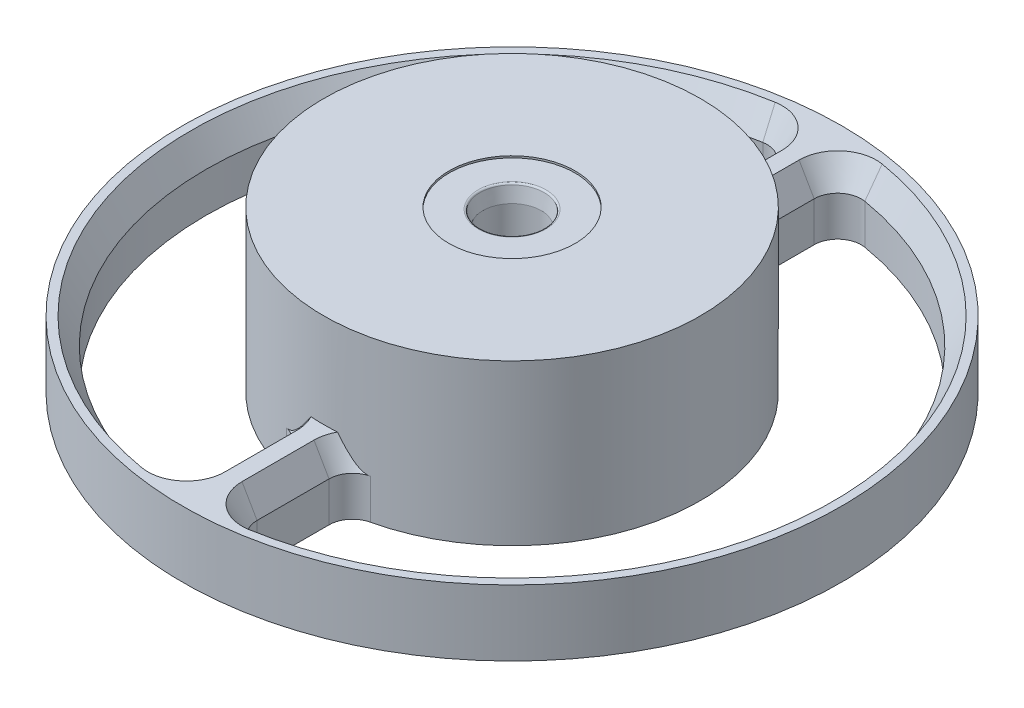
ISO-10303-21;
HEADER;
FILE_DESCRIPTION(('STEP AP214'),'2;1');
FILE_NAME('part.step','',(''),(''),'','','');
FILE_SCHEMA(('AUTOMOTIVE_DESIGN { 1 0 10303 214 1 1 1 1 }'));
ENDSEC;
DATA;
#1=APPLICATION_CONTEXT('core data for automotive mechanical design processes');
#2=APPLICATION_PROTOCOL_DEFINITION('international standard','automotive_design',2000,#1);
#3=PRODUCT_CONTEXT('',#1,'mechanical');
#4=PRODUCT('Part','Part','',(#3));
#5=PRODUCT_RELATED_PRODUCT_CATEGORY('part','',(#4));
#6=PRODUCT_DEFINITION_FORMATION('','',#4);
#7=PRODUCT_DEFINITION_CONTEXT('part definition',#1,'design');
#8=PRODUCT_DEFINITION('design','',#6,#7);
#9=PRODUCT_DEFINITION_SHAPE('','',#8);
#10=(LENGTH_UNIT() NAMED_UNIT(*) SI_UNIT(.MILLI.,.METRE.));
#11=(NAMED_UNIT(*) PLANE_ANGLE_UNIT() SI_UNIT($,.RADIAN.));
#12=(NAMED_UNIT(*) SI_UNIT($,.STERADIAN.) SOLID_ANGLE_UNIT());
#13=UNCERTAINTY_MEASURE_WITH_UNIT(LENGTH_MEASURE(1.E-05),#10,'distance_accuracy_value','');
#14=(GEOMETRIC_REPRESENTATION_CONTEXT(3) GLOBAL_UNCERTAINTY_ASSIGNED_CONTEXT((#13)) GLOBAL_UNIT_ASSIGNED_CONTEXT((#10,
#11,#12)) REPRESENTATION_CONTEXT('',''));
#15=CARTESIAN_POINT('',(0.,0.,0.));
#16=DIRECTION('',(0.,0.,1.));
#17=DIRECTION('',(1.,0.,0.));
#18=AXIS2_PLACEMENT_3D('',#15,#16,#17);
#19=CARTESIAN_POINT('',(-44.45,-21.59,0.));
#20=DIRECTION('',(0.,1.,0.));
#21=DIRECTION('',(0.,0.,1.));
#22=AXIS2_PLACEMENT_3D('',#19,#20,#21);
#23=PLANE('',#22);
#24=CARTESIAN_POINT('',(0.,-21.59,0.));
#25=DIRECTION('',(0.,-1.,0.));
#26=DIRECTION('',(0.,0.,-1.));
#27=AXIS2_PLACEMENT_3D('',#24,#25,#26);
#28=CIRCLE('',#27,44.45);
#29=CARTESIAN_POINT('',(0.,-21.59,-44.45));
#30=VERTEX_POINT('',#29);
#31=EDGE_CURVE('E282',#30,#30,#28,.T.);
#32=ORIENTED_EDGE('',*,*,#31,.T.);
#33=EDGE_LOOP('',(#32));
#34=FACE_BOUND('',#33,.T.);
#35=DIRECTION('',(0.,0.,-1.));
#36=VECTOR('',#35,1.);
#37=CARTESIAN_POINT('',(-3.17499999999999,-21.59,37.5671066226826));
#38=LINE('',#37,#36);
#39=CARTESIAN_POINT('',(-3.17499999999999,-21.59,37.5671066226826));
#40=VERTEX_POINT('',#39);
#41=CARTESIAN_POINT('',(-3.17499999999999,-21.59,27.86051192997));
#42=VERTEX_POINT('',#41);
#43=EDGE_CURVE('E275',#40,#42,#38,.T.);
#44=ORIENTED_EDGE('',*,*,#43,.T.);
#45=CARTESIAN_POINT('',(-6.34999999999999,-21.59,27.86051192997));
#46=DIRECTION('',(0.,1.,0.));
#47=DIRECTION('',(1.,0.,0.));
#48=AXIS2_PLACEMENT_3D('',#45,#46,#47);
#49=CIRCLE('',#48,3.175);
#50=CARTESIAN_POINT('',(-5.64444444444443,-21.59,24.7648994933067));
#51=VERTEX_POINT('',#50);
#52=EDGE_CURVE('E238',#42,#51,#49,.T.);
#53=ORIENTED_EDGE('',*,*,#52,.T.);
#54=CARTESIAN_POINT('',(0.,-21.59,0.));
#55=DIRECTION('',(0.,-1.,0.));
#56=DIRECTION('',(1.,0.,0.));
#57=AXIS2_PLACEMENT_3D('',#54,#55,#56);
#58=CIRCLE('',#57,25.4);
#59=CARTESIAN_POINT('',(-5.64444444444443,-21.59,-24.7648994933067));
#60=VERTEX_POINT('',#59);
#61=EDGE_CURVE('E257',#51,#60,#58,.T.);
#62=ORIENTED_EDGE('',*,*,#61,.T.);
#63=CARTESIAN_POINT('',(-6.34999999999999,-21.59,-27.86051192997));
#64=DIRECTION('',(0.,1.,0.));
#65=DIRECTION('',(-1.,0.,0.));
#66=AXIS2_PLACEMENT_3D('',#63,#64,#65);
#67=CIRCLE('',#66,3.175);
#68=CARTESIAN_POINT('',(-3.17499999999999,-21.59,-27.86051192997));
#69=VERTEX_POINT('',#68);
#70=EDGE_CURVE('E260',#60,#69,#67,.T.);
#71=ORIENTED_EDGE('',*,*,#70,.T.);
#72=DIRECTION('',(0.,0.,-1.));
#73=VECTOR('',#72,1.);
#74=CARTESIAN_POINT('',(-3.17499999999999,-21.59,-37.5671066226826));
#75=LINE('',#74,#73);
#76=CARTESIAN_POINT('',(-3.17499999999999,-21.59,-37.5671066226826));
#77=VERTEX_POINT('',#76);
#78=EDGE_CURVE('E263',#69,#77,#75,.T.);
#79=ORIENTED_EDGE('',*,*,#78,.T.);
#80=CARTESIAN_POINT('',(-6.34999999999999,-21.59,-37.5671066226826));
#81=DIRECTION('',(0.,1.,0.));
#82=DIRECTION('',(1.,0.,0.));
#83=AXIS2_PLACEMENT_3D('',#80,#81,#82);
#84=CIRCLE('',#83,3.17499999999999);
#85=CARTESIAN_POINT('',(-6.87916666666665,-21.59,-40.6976988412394));
#86=VERTEX_POINT('',#85);
#87=EDGE_CURVE('E266',#77,#86,#84,.T.);
#88=ORIENTED_EDGE('',*,*,#87,.T.);
#89=CARTESIAN_POINT('',(0.,-21.59,0.));
#90=DIRECTION('',(0.,1.,0.));
#91=DIRECTION('',(1.,0.,0.));
#92=AXIS2_PLACEMENT_3D('',#89,#90,#91);
#93=CIRCLE('',#92,41.275);
#94=CARTESIAN_POINT('',(-6.87916666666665,-21.59,40.6976988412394));
#95=VERTEX_POINT('',#94);
#96=EDGE_CURVE('E269',#86,#95,#93,.T.);
#97=ORIENTED_EDGE('',*,*,#96,.T.);
#98=CARTESIAN_POINT('',(-6.34999999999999,-21.59,37.5671066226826));
#99=DIRECTION('',(0.,1.,0.));
#100=DIRECTION('',(-1.,0.,0.));
#101=AXIS2_PLACEMENT_3D('',#98,#99,#100);
#102=CIRCLE('',#101,3.175);
#103=EDGE_CURVE('E272',#95,#40,#102,.T.);
#104=ORIENTED_EDGE('',*,*,#103,.T.);
#105=EDGE_LOOP('',(#44,#53,#62,#71,#79,#88,#97,#104));
#106=FACE_BOUND('',#105,.T.);
#107=DIRECTION('',(0.,0.,1.));
#108=VECTOR('',#107,1.);
#109=CARTESIAN_POINT('',(3.17500000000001,-21.59,37.5671066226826));
#110=LINE('',#109,#108);
#111=CARTESIAN_POINT('',(3.17500000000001,-21.59,27.86051192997));
#112=VERTEX_POINT('',#111);
#113=CARTESIAN_POINT('',(3.17500000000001,-21.59,37.5671066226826));
#114=VERTEX_POINT('',#113);
#115=EDGE_CURVE('E204',#112,#114,#110,.T.);
#116=ORIENTED_EDGE('',*,*,#115,.T.);
#117=CARTESIAN_POINT('',(6.35000000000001,-21.59,37.5671066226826));
#118=DIRECTION('',(0.,1.,0.));
#119=DIRECTION('',(1.,0.,0.));
#120=AXIS2_PLACEMENT_3D('',#117,#118,#119);
#121=CIRCLE('',#120,3.175);
#122=CARTESIAN_POINT('',(6.87916666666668,-21.59,40.6976988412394));
#123=VERTEX_POINT('',#122);
#124=EDGE_CURVE('E201',#114,#123,#121,.T.);
#125=ORIENTED_EDGE('',*,*,#124,.T.);
#126=CARTESIAN_POINT('',(0.,-21.59,0.));
#127=DIRECTION('',(0.,1.,0.));
#128=DIRECTION('',(-1.,0.,0.));
#129=AXIS2_PLACEMENT_3D('',#126,#127,#128);
#130=CIRCLE('',#129,41.275);
#131=CARTESIAN_POINT('',(6.87916666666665,-21.59,-40.6976988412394));
#132=VERTEX_POINT('',#131);
#133=EDGE_CURVE('E207',#123,#132,#130,.T.);
#134=ORIENTED_EDGE('',*,*,#133,.T.);
#135=CARTESIAN_POINT('',(6.34999999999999,-21.59,-37.5671066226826));
#136=DIRECTION('',(0.,1.,0.));
#137=DIRECTION('',(-1.,0.,0.));
#138=AXIS2_PLACEMENT_3D('',#135,#136,#137);
#139=CIRCLE('',#138,3.17499999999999);
#140=CARTESIAN_POINT('',(3.175,-21.59,-37.5671066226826));
#141=VERTEX_POINT('',#140);
#142=EDGE_CURVE('E211',#132,#141,#139,.T.);
#143=ORIENTED_EDGE('',*,*,#142,.T.);
#144=DIRECTION('',(0.,0.,1.));
#145=VECTOR('',#144,1.);
#146=CARTESIAN_POINT('',(3.17499999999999,-21.59,-37.5671066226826));
#147=LINE('',#146,#145);
#148=CARTESIAN_POINT('',(3.17499999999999,-21.59,-27.86051192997));
#149=VERTEX_POINT('',#148);
#150=EDGE_CURVE('E224',#141,#149,#147,.T.);
#151=ORIENTED_EDGE('',*,*,#150,.T.);
#152=CARTESIAN_POINT('',(6.34999999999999,-21.59,-27.86051192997));
#153=DIRECTION('',(0.,1.,0.));
#154=DIRECTION('',(1.,0.,0.));
#155=AXIS2_PLACEMENT_3D('',#152,#153,#154);
#156=CIRCLE('',#155,3.175);
#157=CARTESIAN_POINT('',(5.64444444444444,-21.59,-24.7648994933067));
#158=VERTEX_POINT('',#157);
#159=EDGE_CURVE('E227',#149,#158,#156,.T.);
#160=ORIENTED_EDGE('',*,*,#159,.T.);
#161=CARTESIAN_POINT('',(0.,-21.59,0.));
#162=DIRECTION('',(0.,-1.,0.));
#163=DIRECTION('',(-1.,0.,0.));
#164=AXIS2_PLACEMENT_3D('',#161,#162,#163);
#165=CIRCLE('',#164,25.4);
#166=CARTESIAN_POINT('',(5.64444444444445,-21.59,24.7648994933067));
#167=VERTEX_POINT('',#166);
#168=EDGE_CURVE('E230',#158,#167,#165,.T.);
#169=ORIENTED_EDGE('',*,*,#168,.T.);
#170=CARTESIAN_POINT('',(6.35000000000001,-21.59,27.86051192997));
#171=DIRECTION('',(0.,1.,0.));
#172=DIRECTION('',(-1.,0.,0.));
#173=AXIS2_PLACEMENT_3D('',#170,#171,#172);
#174=CIRCLE('',#173,3.175);
#175=EDGE_CURVE('E233',#167,#112,#174,.T.);
#176=ORIENTED_EDGE('',*,*,#175,.T.);
#177=EDGE_LOOP('',(#116,#125,#134,#143,#151,#160,#169,#176));
#178=FACE_BOUND('',#177,.T.);
#179=CARTESIAN_POINT('',(0.,-21.59,0.));
#180=DIRECTION('',(0.,1.,0.));
#181=DIRECTION('',(0.,0.,1.));
#182=AXIS2_PLACEMENT_3D('',#179,#180,#181);
#183=CIRCLE('',#182,9.652);
#184=CARTESIAN_POINT('',(0.,-21.59,9.652));
#185=VERTEX_POINT('',#184);
#186=EDGE_CURVE('E219',#185,#185,#183,.T.);
#187=ORIENTED_EDGE('',*,*,#186,.T.);
#188=EDGE_LOOP('',(#187));
#189=FACE_BOUND('',#188,.T.);
#190=ADVANCED_FACE('F34',(#34,#106,#178,#189),#23,.F.);
#191=CARTESIAN_POINT('',(0.,0.,0.));
#192=DIRECTION('',(0.,-1.,0.));
#193=DIRECTION('',(0.,0.,-1.));
#194=AXIS2_PLACEMENT_3D('',#191,#192,#193);
#195=PLANE('',#194);
#196=CARTESIAN_POINT('',(0.,0.,0.));
#197=DIRECTION('',(0.,1.,0.));
#198=DIRECTION('',(0.,0.,1.));
#199=AXIS2_PLACEMENT_3D('',#196,#197,#198);
#200=CIRCLE('',#199,8.5);
#201=CARTESIAN_POINT('',(0.,0.,8.5));
#202=VERTEX_POINT('',#201);
#203=EDGE_CURVE('E930',#202,#202,#200,.T.);
#204=ORIENTED_EDGE('',*,*,#203,.F.);
#205=EDGE_LOOP('',(#204));
#206=FACE_BOUND('',#205,.T.);
#207=CARTESIAN_POINT('',(0.,0.,0.));
#208=DIRECTION('',(0.,-1.,0.));
#209=DIRECTION('',(0.,0.,-1.));
#210=AXIS2_PLACEMENT_3D('',#207,#208,#209);
#211=CIRCLE('',#210,25.4);
#212=CARTESIAN_POINT('',(0.,0.,-25.4));
#213=VERTEX_POINT('',#212);
#214=EDGE_CURVE('E312',#213,#213,#211,.T.);
#215=ORIENTED_EDGE('',*,*,#214,.F.);
#216=EDGE_LOOP('',(#215));
#217=FACE_BOUND('',#216,.T.);
#218=ADVANCED_FACE('F394',(#206,#217),#195,.F.);
#219=CARTESIAN_POINT('',(0.,0.,0.));
#220=DIRECTION('',(0.,-1.,0.));
#221=DIRECTION('',(0.,0.,-1.));
#222=AXIS2_PLACEMENT_3D('',#219,#220,#221);
#223=CYLINDRICAL_SURFACE('',#222,25.4);
#224=CARTESIAN_POINT('',(0.,-12.7,0.));
#225=DIRECTION('',(0.,-1.,0.));
#226=DIRECTION('',(0.,0.,-1.));
#227=AXIS2_PLACEMENT_3D('',#224,#225,#226);
#228=CIRCLE('',#227,25.4);
#229=CARTESIAN_POINT('',(-1.79566705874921,-12.7,-25.3364476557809));
#230=VERTEX_POINT('',#229);
#231=CARTESIAN_POINT('',(1.79566705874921,-12.7,-25.3364476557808));
#232=VERTEX_POINT('',#231);
#233=EDGE_CURVE('E309',#230,#232,#228,.T.);
#234=ORIENTED_EDGE('',*,*,#233,.F.);
#235=CARTESIAN_POINT('',(-1.79566705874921,-12.7,-25.3364476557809));
#236=CARTESIAN_POINT('',(-1.89089241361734,-12.8385463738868,-25.3296947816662));
#237=CARTESIAN_POINT('',(-1.98690869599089,-12.9765322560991,-25.3223541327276));
#238=CARTESIAN_POINT('',(-2.18101546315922,-13.2510683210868,-25.3063769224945));
#239=CARTESIAN_POINT('',(-2.27910700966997,-13.3876177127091,-25.2977396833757));
#240=CARTESIAN_POINT('',(-2.47971236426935,-13.6614884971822,-25.2788719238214));
#241=CARTESIAN_POINT('',(-2.58227521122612,-13.7987721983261,-25.2686133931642));
#242=CARTESIAN_POINT('',(-2.79060472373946,-14.0706973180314,-25.2464552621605));
#243=CARTESIAN_POINT('',(-2.89637043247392,-14.2053395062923,-25.23455614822));
#244=CARTESIAN_POINT('',(-3.11223944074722,-14.4713418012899,-25.2088438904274));
#245=CARTESIAN_POINT('',(-3.22235015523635,-14.6026956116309,-25.1950273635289));
#246=CARTESIAN_POINT('',(-3.447979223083,-14.8603671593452,-25.165142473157));
#247=CARTESIAN_POINT('',(-3.56349591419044,-14.9866864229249,-25.1490747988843));
#248=CARTESIAN_POINT('',(-3.80114017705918,-15.2312969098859,-25.1142531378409));
#249=CARTESIAN_POINT('',(-3.92322562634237,-15.3496303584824,-25.0955152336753));
#250=CARTESIAN_POINT('',(-4.11352098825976,-15.5183991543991,-25.0647768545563));
#251=CARTESIAN_POINT('',(-4.17809796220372,-15.5731636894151,-25.05410082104));
#252=CARTESIAN_POINT('',(-4.31004996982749,-15.6789715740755,-25.0317389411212));
#253=CARTESIAN_POINT('',(-4.3774238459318,-15.7300164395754,-25.0200535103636));
#254=CARTESIAN_POINT('',(-4.49605478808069,-15.8136732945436,-24.9989605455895));
#255=CARTESIAN_POINT('',(-4.54653951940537,-15.8474431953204,-24.9898319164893));
#256=CARTESIAN_POINT('',(-4.64927981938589,-15.9119497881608,-24.9709217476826));
#257=CARTESIAN_POINT('',(-4.7015355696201,-15.942686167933,-24.9611401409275));
#258=CARTESIAN_POINT('',(-4.86056049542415,-16.0290689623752,-24.9308346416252));
#259=CARTESIAN_POINT('',(-4.97024504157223,-16.0793713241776,-24.9092341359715));
#260=CARTESIAN_POINT('',(-5.12806864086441,-16.1351182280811,-24.8769976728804));
#261=CARTESIAN_POINT('',(-5.17343783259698,-16.1493217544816,-24.8676041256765));
#262=CARTESIAN_POINT('',(-5.26506667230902,-16.1740698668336,-24.8483653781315));
#263=CARTESIAN_POINT('',(-5.31132595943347,-16.184615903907,-24.8385203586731));
#264=CARTESIAN_POINT('',(-5.40519377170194,-16.2018258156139,-24.8182637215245));
#265=CARTESIAN_POINT('',(-5.45281212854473,-16.2084292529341,-24.8078458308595));
#266=CARTESIAN_POINT('',(-5.54844013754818,-16.2172974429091,-24.7866341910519));
#267=CARTESIAN_POINT('',(-5.59645026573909,-16.2195557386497,-24.7758399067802));
#268=CARTESIAN_POINT('',(-5.64444444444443,-16.2195272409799,-24.7648994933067));
#269=B_SPLINE_CURVE_WITH_KNOTS('',3,(#235,#236,#237,#238,#239,#240,#241,#242,#243,#244,#245,
#246,#247,#248,#249,#250,#251,#252,#253,#254,#255,#256,#257,#258,#259,#260,#261,#262,#263,#264,
#265,#266,#267,#268),.UNSPECIFIED.,.F.,.F.,(4,2,2,2,2,2,2,2,2,2,2,2,2,2,2,2,4),(0.,
0.50476505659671,1.00979491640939,1.52476363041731,2.03957999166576,2.55531651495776,
3.07089548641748,3.58349101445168,3.83941843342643,4.09524096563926,4.27939852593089,
4.46357502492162,4.82947103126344,4.97473430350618,5.11993987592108,5.26731772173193,
5.414914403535),.UNSPECIFIED.);
#270=CARTESIAN_POINT('',(-5.64444444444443,-16.2195272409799,-24.7648994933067));
#271=VERTEX_POINT('',#270);
#272=EDGE_CURVE('E371',#230,#271,#269,.T.);
#273=ORIENTED_EDGE('',*,*,#272,.T.);
#274=DIRECTION('',(0.,1.,0.));
#275=VECTOR('',#274,1.);
#276=CARTESIAN_POINT('',(-5.64444444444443,-21.59,-24.7648994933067));
#277=LINE('',#276,#275);
#278=EDGE_CURVE('E298',#60,#271,#277,.T.);
#279=ORIENTED_EDGE('',*,*,#278,.F.);
#280=ORIENTED_EDGE('',*,*,#61,.F.);
#281=DIRECTION('',(0.,1.,0.));
#282=VECTOR('',#281,1.);
#283=CARTESIAN_POINT('',(-5.64444444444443,-21.59,24.7648994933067));
#284=LINE('',#283,#282);
#285=CARTESIAN_POINT('',(-5.64444444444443,-16.2195272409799,24.7648994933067));
#286=VERTEX_POINT('',#285);
#287=EDGE_CURVE('E278',#51,#286,#284,.T.);
#288=ORIENTED_EDGE('',*,*,#287,.T.);
#289=CARTESIAN_POINT('',(-5.64444444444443,-16.2195272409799,24.7648994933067));
#290=CARTESIAN_POINT('',(-5.5877647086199,-16.2195807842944,24.7778208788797));
#291=CARTESIAN_POINT('',(-5.53107452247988,-16.2164178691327,24.7905343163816));
#292=CARTESIAN_POINT('',(-5.41837993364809,-16.204085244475,24.8154073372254));
#293=CARTESIAN_POINT('',(-5.36237412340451,-16.1949312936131,24.8275682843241));
#294=CARTESIAN_POINT('',(-5.25286394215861,-16.1713427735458,24.8509655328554));
#295=CARTESIAN_POINT('',(-5.19933218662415,-16.1570485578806,24.8622174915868));
#296=CARTESIAN_POINT('',(-5.09359581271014,-16.1237590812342,24.8840952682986));
#297=CARTESIAN_POINT('',(-5.04139215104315,-16.1047605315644,24.8947206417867));
#298=CARTESIAN_POINT('',(-4.91830370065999,-16.0544425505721,24.9193826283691));
#299=CARTESIAN_POINT('',(-4.84814007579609,-16.0212153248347,24.9331187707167));
#300=CARTESIAN_POINT('',(-4.71089946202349,-15.948543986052,24.9594133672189));
#301=CARTESIAN_POINT('',(-4.64382393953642,-15.9090969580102,24.9719712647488));
#302=CARTESIAN_POINT('',(-4.51090576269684,-15.8242783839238,24.9963279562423));
#303=CARTESIAN_POINT('',(-4.44513948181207,-15.778780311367,25.0080988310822));
#304=CARTESIAN_POINT('',(-4.31640383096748,-15.6838470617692,25.0306397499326));
#305=CARTESIAN_POINT('',(-4.25343334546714,-15.6344134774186,25.0414101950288));
#306=CARTESIAN_POINT('',(-4.12748685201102,-15.5304384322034,25.0624836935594));
#307=CARTESIAN_POINT('',(-4.06460835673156,-15.4757724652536,25.0727516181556));
#308=CARTESIAN_POINT('',(-3.94111272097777,-15.3637920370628,25.0924597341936));
#309=CARTESIAN_POINT('',(-3.88049606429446,-15.3064770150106,25.1018997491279));
#310=CARTESIAN_POINT('',(-3.70145449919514,-15.1312829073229,25.1291436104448));
#311=CARTESIAN_POINT('',(-3.58595051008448,-15.0102507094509,25.1458526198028));
#312=CARTESIAN_POINT('',(-3.36022449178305,-14.762045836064,25.1770114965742));
#313=CARTESIAN_POINT('',(-3.25003195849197,-14.6348453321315,25.1914495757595));
#314=CARTESIAN_POINT('',(-3.03411042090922,-14.3764893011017,25.2183664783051));
#315=CARTESIAN_POINT('',(-2.92838220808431,-14.2453330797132,25.2308449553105));
#316=CARTESIAN_POINT('',(-2.73407356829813,-13.9975754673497,25.2525858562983));
#317=CARTESIAN_POINT('',(-2.64506513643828,-13.881325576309,25.2620554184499));
#318=CARTESIAN_POINT('',(-2.46918238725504,-13.6471144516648,25.2798526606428));
#319=CARTESIAN_POINT('',(-2.38230836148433,-13.5291529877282,25.2881801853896));
#320=CARTESIAN_POINT('',(-2.21131659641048,-13.2932439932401,25.3037026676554));
#321=CARTESIAN_POINT('',(-2.12717866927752,-13.1753118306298,25.3109095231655));
#322=CARTESIAN_POINT('',(-1.96038456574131,-12.9383945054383,25.3243729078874));
#323=CARTESIAN_POINT('',(-1.8777280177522,-12.81940961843,25.3306296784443));
#324=CARTESIAN_POINT('',(-1.79566705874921,-12.7,25.3364476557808));
#325=B_SPLINE_CURVE_WITH_KNOTS('',3,(#289,#290,#291,#292,#293,#294,#295,#296,#297,#298,#299,
#300,#301,#302,#303,#304,#305,#306,#307,#308,#309,#310,#311,#312,#313,#314,#315,#316,#317,#318,
#319,#320,#321,#322,#323,#324),.UNSPECIFIED.,.F.,.F.,(4,2,2,2,2,2,2,2,2,2,2,2,2,2,2,2,2,4),(0.,
0.174258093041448,0.348059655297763,0.517436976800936,0.686933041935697,0.923041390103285,
1.15926072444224,1.40157035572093,1.64378241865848,1.89553653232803,2.14734418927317,
2.65140544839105,3.15800254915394,3.6646890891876,4.10481059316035,4.54499188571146,
4.98012288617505,5.41514316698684),.UNSPECIFIED.);
#326=CARTESIAN_POINT('',(-1.79566705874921,-12.7,25.3364476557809));
#327=VERTEX_POINT('',#326);
#328=EDGE_CURVE('E378',#286,#327,#325,.T.);
#329=ORIENTED_EDGE('',*,*,#328,.T.);
#330=CARTESIAN_POINT('',(1.79566705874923,-12.7,25.3364476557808));
#331=VERTEX_POINT('',#330);
#332=EDGE_CURVE('E308',#331,#327,#228,.T.);
#333=ORIENTED_EDGE('',*,*,#332,.F.);
#334=CARTESIAN_POINT('',(1.79566705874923,-12.7,25.3364476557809));
#335=CARTESIAN_POINT('',(1.89089241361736,-12.8385463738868,25.3296947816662));
#336=CARTESIAN_POINT('',(1.98690869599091,-12.9765322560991,25.3223541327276));
#337=CARTESIAN_POINT('',(2.18101546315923,-13.2510683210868,25.3063769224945));
#338=CARTESIAN_POINT('',(2.27910700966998,-13.3876177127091,25.2977396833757));
#339=CARTESIAN_POINT('',(2.47971236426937,-13.6614884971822,25.2788719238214));
#340=CARTESIAN_POINT('',(2.58227521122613,-13.7987721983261,25.2686133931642));
#341=CARTESIAN_POINT('',(2.79060472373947,-14.0706973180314,25.2464552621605));
#342=CARTESIAN_POINT('',(2.89637043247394,-14.2053395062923,25.23455614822));
#343=CARTESIAN_POINT('',(3.11223944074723,-14.4713418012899,25.2088438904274));
#344=CARTESIAN_POINT('',(3.22235015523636,-14.6026956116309,25.1950273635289));
#345=CARTESIAN_POINT('',(3.447979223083,-14.8603671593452,25.165142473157));
#346=CARTESIAN_POINT('',(3.56349591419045,-14.9866864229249,25.1490747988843));
#347=CARTESIAN_POINT('',(3.80114017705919,-15.2312969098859,25.1142531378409));
#348=CARTESIAN_POINT('',(3.92322562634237,-15.3496303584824,25.0955152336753));
#349=CARTESIAN_POINT('',(4.11352098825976,-15.5183991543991,25.0647768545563));
#350=CARTESIAN_POINT('',(4.17809796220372,-15.5731636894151,25.05410082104));
#351=CARTESIAN_POINT('',(4.3100499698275,-15.6789715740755,25.0317389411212));
#352=CARTESIAN_POINT('',(4.3774238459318,-15.7300164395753,25.0200535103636));
#353=CARTESIAN_POINT('',(4.49605478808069,-15.8136732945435,24.9989605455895));
#354=CARTESIAN_POINT('',(4.54653951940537,-15.8474431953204,24.9898319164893));
#355=CARTESIAN_POINT('',(4.64927981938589,-15.9119497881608,24.9709217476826));
#356=CARTESIAN_POINT('',(4.7015355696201,-15.942686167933,24.9611401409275));
#357=CARTESIAN_POINT('',(4.86056049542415,-16.0290689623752,24.9308346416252));
#358=CARTESIAN_POINT('',(4.97024504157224,-16.0793713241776,24.9092341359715));
#359=CARTESIAN_POINT('',(5.12806864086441,-16.1351182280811,24.8769976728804));
#360=CARTESIAN_POINT('',(5.17343783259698,-16.1493217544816,24.8676041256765));
#361=CARTESIAN_POINT('',(5.26506667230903,-16.1740698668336,24.8483653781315));
#362=CARTESIAN_POINT('',(5.31132595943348,-16.184615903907,24.8385203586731));
#363=CARTESIAN_POINT('',(5.40519377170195,-16.2018258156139,24.8182637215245));
#364=CARTESIAN_POINT('',(5.45281212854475,-16.2084292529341,24.8078458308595));
#365=CARTESIAN_POINT('',(5.5484401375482,-16.2172974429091,24.7866341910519));
#366=CARTESIAN_POINT('',(5.59645026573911,-16.2195557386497,24.7758399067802));
#367=CARTESIAN_POINT('',(5.64444444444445,-16.2195272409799,24.7648994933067));
#368=B_SPLINE_CURVE_WITH_KNOTS('',3,(#334,#335,#336,#337,#338,#339,#340,#341,#342,#343,#344,
#345,#346,#347,#348,#349,#350,#351,#352,#353,#354,#355,#356,#357,#358,#359,#360,#361,#362,#363,
#364,#365,#366,#367),.UNSPECIFIED.,.F.,.F.,(4,2,2,2,2,2,2,2,2,2,2,2,2,2,2,2,4),(0.,
0.504765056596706,1.00979491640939,1.52476363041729,2.03957999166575,2.55531651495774,
3.07089548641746,3.58349101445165,3.8394184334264,4.09524096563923,4.27939852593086,
4.46357502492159,4.82947103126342,4.97473430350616,5.11993987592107,5.26731772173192,
5.414914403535),.UNSPECIFIED.);
#369=CARTESIAN_POINT('',(5.64444444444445,-16.2195272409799,24.7648994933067));
#370=VERTEX_POINT('',#369);
#371=EDGE_CURVE('E44',#331,#370,#368,.T.);
#372=ORIENTED_EDGE('',*,*,#371,.T.);
#373=DIRECTION('',(0.,1.,0.));
#374=VECTOR('',#373,1.);
#375=CARTESIAN_POINT('',(5.64444444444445,-21.59,24.7648994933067));
#376=LINE('',#375,#374);
#377=EDGE_CURVE('E242',#167,#370,#376,.T.);
#378=ORIENTED_EDGE('',*,*,#377,.F.);
#379=ORIENTED_EDGE('',*,*,#168,.F.);
#380=DIRECTION('',(0.,1.,0.));
#381=VECTOR('',#380,1.);
#382=CARTESIAN_POINT('',(5.64444444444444,-21.59,-24.7648994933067));
#383=LINE('',#382,#381);
#384=CARTESIAN_POINT('',(5.64444444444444,-16.2195272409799,-24.7648994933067));
#385=VERTEX_POINT('',#384);
#386=EDGE_CURVE('E245',#158,#385,#383,.T.);
#387=ORIENTED_EDGE('',*,*,#386,.T.);
#388=CARTESIAN_POINT('',(5.64444444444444,-16.2195272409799,-24.7648994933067));
#389=CARTESIAN_POINT('',(5.5877647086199,-16.2195807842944,-24.7778208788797));
#390=CARTESIAN_POINT('',(5.53107452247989,-16.2164178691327,-24.7905343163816));
#391=CARTESIAN_POINT('',(5.4183799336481,-16.2040852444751,-24.8154073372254));
#392=CARTESIAN_POINT('',(5.36237412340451,-16.1949312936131,-24.8275682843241));
#393=CARTESIAN_POINT('',(5.25286394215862,-16.1713427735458,-24.8509655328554));
#394=CARTESIAN_POINT('',(5.19933218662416,-16.1570485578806,-24.8622174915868));
#395=CARTESIAN_POINT('',(5.09359581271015,-16.1237590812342,-24.8840952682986));
#396=CARTESIAN_POINT('',(5.04139215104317,-16.1047605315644,-24.8947206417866));
#397=CARTESIAN_POINT('',(4.91830370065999,-16.0544425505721,-24.9193826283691));
#398=CARTESIAN_POINT('',(4.8481400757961,-16.0212153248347,-24.9331187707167));
#399=CARTESIAN_POINT('',(4.71089946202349,-15.948543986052,-24.9594133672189));
#400=CARTESIAN_POINT('',(4.64382393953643,-15.9090969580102,-24.9719712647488));
#401=CARTESIAN_POINT('',(4.51090576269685,-15.8242783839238,-24.9963279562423));
#402=CARTESIAN_POINT('',(4.44513948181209,-15.778780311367,-25.0080988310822));
#403=CARTESIAN_POINT('',(4.31640383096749,-15.6838470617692,-25.0306397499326));
#404=CARTESIAN_POINT('',(4.25343334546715,-15.6344134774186,-25.0414101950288));
#405=CARTESIAN_POINT('',(4.12748685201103,-15.5304384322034,-25.0624836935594));
#406=CARTESIAN_POINT('',(4.06460835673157,-15.4757724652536,-25.0727516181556));
#407=CARTESIAN_POINT('',(3.94111272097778,-15.3637920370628,-25.0924597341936));
#408=CARTESIAN_POINT('',(3.88049606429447,-15.3064770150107,-25.1018997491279));
#409=CARTESIAN_POINT('',(3.70145449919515,-15.1312829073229,-25.1291436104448));
#410=CARTESIAN_POINT('',(3.58595051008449,-15.0102507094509,-25.1458526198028));
#411=CARTESIAN_POINT('',(3.36022449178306,-14.762045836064,-25.1770114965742));
#412=CARTESIAN_POINT('',(3.25003195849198,-14.6348453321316,-25.1914495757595));
#413=CARTESIAN_POINT('',(3.03411042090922,-14.3764893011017,-25.2183664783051));
#414=CARTESIAN_POINT('',(2.92838220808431,-14.2453330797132,-25.2308449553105));
#415=CARTESIAN_POINT('',(2.73407356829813,-13.9975754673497,-25.2525858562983));
#416=CARTESIAN_POINT('',(2.64506513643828,-13.881325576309,-25.2620554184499));
#417=CARTESIAN_POINT('',(2.46918238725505,-13.6471144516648,-25.2798526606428));
#418=CARTESIAN_POINT('',(2.38230836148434,-13.5291529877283,-25.2881801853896));
#419=CARTESIAN_POINT('',(2.21131659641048,-13.2932439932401,-25.3037026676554));
#420=CARTESIAN_POINT('',(2.12717866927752,-13.1753118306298,-25.3109095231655));
#421=CARTESIAN_POINT('',(1.96038456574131,-12.9383945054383,-25.3243729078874));
#422=CARTESIAN_POINT('',(1.8777280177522,-12.81940961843,-25.3306296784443));
#423=CARTESIAN_POINT('',(1.79566705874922,-12.7,-25.3364476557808));
#424=B_SPLINE_CURVE_WITH_KNOTS('',3,(#388,#389,#390,#391,#392,#393,#394,#395,#396,#397,#398,
#399,#400,#401,#402,#403,#404,#405,#406,#407,#408,#409,#410,#411,#412,#413,#414,#415,#416,#417,
#418,#419,#420,#421,#422,#423),.UNSPECIFIED.,.F.,.F.,(4,2,2,2,2,2,2,2,2,2,2,2,2,2,2,2,2,4),(0.,
0.174258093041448,0.348059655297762,0.517436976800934,0.686933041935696,0.923041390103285,
1.15926072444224,1.40157035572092,1.64378241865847,1.89553653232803,2.14734418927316,
2.65140544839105,3.15800254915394,3.6646890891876,4.10481059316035,4.54499188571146,
4.98012288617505,5.41514316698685),.UNSPECIFIED.);
#425=EDGE_CURVE('E11',#385,#232,#424,.T.);
#426=ORIENTED_EDGE('',*,*,#425,.T.);
#427=EDGE_LOOP('',(#234,#273,#279,#280,#288,#329,#333,#372,#378,#379,#387,#426));
#428=FACE_BOUND('',#427,.T.);
#429=ORIENTED_EDGE('',*,*,#214,.T.);
#430=EDGE_LOOP('',(#429));
#431=FACE_BOUND('',#430,.T.);
#432=ADVANCED_FACE('F384',(#428,#431),#223,.T.);
#433=CARTESIAN_POINT('',(-25.4,-12.7,0.));
#434=DIRECTION('',(0.,-1.,0.));
#435=DIRECTION('',(0.,0.,-1.));
#436=AXIS2_PLACEMENT_3D('',#433,#434,#435);
#437=PLANE('',#436);
#438=CARTESIAN_POINT('',(0.,-12.7,0.));
#439=DIRECTION('',(0.,-1.,0.));
#440=DIRECTION('',(0.,0.,-1.));
#441=AXIS2_PLACEMENT_3D('',#438,#439,#440);
#442=CIRCLE('',#441,44.45);
#443=CARTESIAN_POINT('',(0.,-12.7,-44.45));
#444=VERTEX_POINT('',#443);
#445=EDGE_CURVE('E305',#444,#444,#442,.T.);
#446=ORIENTED_EDGE('',*,*,#445,.F.);
#447=EDGE_LOOP('',(#446));
#448=FACE_BOUND('',#447,.T.);
#449=DIRECTION('',(0.,0.,1.));
#450=VECTOR('',#449,1.);
#451=CARTESIAN_POINT('',(-1.14299999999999,-12.7,0.));
#452=LINE('',#451,#450);
#453=CARTESIAN_POINT('',(-1.143,-12.7,-37.5671066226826));
#454=VERTEX_POINT('',#453);
#455=CARTESIAN_POINT('',(-1.143,-12.7,-27.86051192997));
#456=VERTEX_POINT('',#455);
#457=EDGE_CURVE('E340',#454,#456,#452,.T.);
#458=ORIENTED_EDGE('',*,*,#457,.T.);
#459=CARTESIAN_POINT('',(-6.34999999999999,-12.7,-27.86051192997));
#460=DIRECTION('',(0.,-1.,0.));
#461=DIRECTION('',(0.,0.,-1.));
#462=AXIS2_PLACEMENT_3D('',#459,#460,#461);
#463=CIRCLE('',#462,5.20699999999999);
#464=EDGE_CURVE('E344',#456,#230,#463,.T.);
#465=ORIENTED_EDGE('',*,*,#464,.T.);
#466=ORIENTED_EDGE('',*,*,#233,.T.);
#467=CARTESIAN_POINT('',(6.34999999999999,-12.7,-27.86051192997));
#468=DIRECTION('',(0.,-1.,0.));
#469=DIRECTION('',(0.,0.,-1.));
#470=AXIS2_PLACEMENT_3D('',#467,#468,#469);
#471=CIRCLE('',#470,5.20699999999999);
#472=CARTESIAN_POINT('',(1.143,-12.7,-27.86051192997));
#473=VERTEX_POINT('',#472);
#474=EDGE_CURVE('E328',#232,#473,#471,.T.);
#475=ORIENTED_EDGE('',*,*,#474,.T.);
#476=DIRECTION('',(0.,0.,-1.));
#477=VECTOR('',#476,1.);
#478=CARTESIAN_POINT('',(1.14300000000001,-12.7,0.));
#479=LINE('',#478,#477);
#480=CARTESIAN_POINT('',(1.143,-12.7,-37.5671066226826));
#481=VERTEX_POINT('',#480);
#482=EDGE_CURVE('E324',#473,#481,#479,.T.);
#483=ORIENTED_EDGE('',*,*,#482,.T.);
#484=CARTESIAN_POINT('',(6.34999999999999,-12.7,-37.5671066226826));
#485=DIRECTION('',(0.,-1.,0.));
#486=DIRECTION('',(0.,0.,-1.));
#487=AXIS2_PLACEMENT_3D('',#484,#485,#486);
#488=CIRCLE('',#487,5.20699999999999);
#489=CARTESIAN_POINT('',(7.21783333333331,-12.7,-42.7012778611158));
#490=VERTEX_POINT('',#489);
#491=EDGE_CURVE('E320',#481,#490,#488,.T.);
#492=ORIENTED_EDGE('',*,*,#491,.T.);
#493=CARTESIAN_POINT('',(0.,-12.7,0.));
#494=DIRECTION('',(0.,-1.,0.));
#495=DIRECTION('',(0.,0.,-1.));
#496=AXIS2_PLACEMENT_3D('',#493,#494,#495);
#497=CIRCLE('',#496,43.307);
#498=CARTESIAN_POINT('',(7.21783333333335,-12.7,42.7012778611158));
#499=VERTEX_POINT('',#498);
#500=EDGE_CURVE('E318',#490,#499,#497,.T.);
#501=ORIENTED_EDGE('',*,*,#500,.T.);
#502=CARTESIAN_POINT('',(6.35000000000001,-12.7,37.5671066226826));
#503=DIRECTION('',(0.,-1.,0.));
#504=DIRECTION('',(0.,0.,-1.));
#505=AXIS2_PLACEMENT_3D('',#502,#503,#504);
#506=CIRCLE('',#505,5.20699999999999);
#507=CARTESIAN_POINT('',(1.14300000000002,-12.7,37.5671066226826));
#508=VERTEX_POINT('',#507);
#509=EDGE_CURVE('E322',#499,#508,#506,.T.);
#510=ORIENTED_EDGE('',*,*,#509,.T.);
#511=DIRECTION('',(0.,0.,-1.));
#512=VECTOR('',#511,1.);
#513=CARTESIAN_POINT('',(1.14300000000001,-12.7,0.));
#514=LINE('',#513,#512);
#515=CARTESIAN_POINT('',(1.14300000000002,-12.7,27.86051192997));
#516=VERTEX_POINT('',#515);
#517=EDGE_CURVE('E326',#508,#516,#514,.T.);
#518=ORIENTED_EDGE('',*,*,#517,.T.);
#519=CARTESIAN_POINT('',(6.35000000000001,-12.7,27.86051192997));
#520=DIRECTION('',(0.,-1.,0.));
#521=DIRECTION('',(0.,0.,-1.));
#522=AXIS2_PLACEMENT_3D('',#519,#520,#521);
#523=CIRCLE('',#522,5.20699999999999);
#524=EDGE_CURVE('E330',#516,#331,#523,.T.);
#525=ORIENTED_EDGE('',*,*,#524,.T.);
#526=ORIENTED_EDGE('',*,*,#332,.T.);
#527=CARTESIAN_POINT('',(-6.34999999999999,-12.7,27.86051192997));
#528=DIRECTION('',(0.,-1.,0.));
#529=DIRECTION('',(0.,0.,-1.));
#530=AXIS2_PLACEMENT_3D('',#527,#528,#529);
#531=CIRCLE('',#530,5.20699999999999);
#532=CARTESIAN_POINT('',(-1.143,-12.7,27.86051192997));
#533=VERTEX_POINT('',#532);
#534=EDGE_CURVE('E342',#327,#533,#531,.T.);
#535=ORIENTED_EDGE('',*,*,#534,.T.);
#536=DIRECTION('',(0.,0.,1.));
#537=VECTOR('',#536,1.);
#538=CARTESIAN_POINT('',(-1.143,-12.7,0.));
#539=LINE('',#538,#537);
#540=CARTESIAN_POINT('',(-1.143,-12.7,37.5671066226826));
#541=VERTEX_POINT('',#540);
#542=EDGE_CURVE('E338',#533,#541,#539,.T.);
#543=ORIENTED_EDGE('',*,*,#542,.T.);
#544=CARTESIAN_POINT('',(-6.34999999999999,-12.7,37.5671066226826));
#545=DIRECTION('',(0.,-1.,0.));
#546=DIRECTION('',(0.,0.,-1.));
#547=AXIS2_PLACEMENT_3D('',#544,#545,#546);
#548=CIRCLE('',#547,5.20699999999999);
#549=CARTESIAN_POINT('',(-7.21783333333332,-12.7,42.7012778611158));
#550=VERTEX_POINT('',#549);
#551=EDGE_CURVE('E334',#541,#550,#548,.T.);
#552=ORIENTED_EDGE('',*,*,#551,.T.);
#553=CARTESIAN_POINT('',(0.,-12.7,0.));
#554=DIRECTION('',(0.,-1.,0.));
#555=DIRECTION('',(0.,0.,-1.));
#556=AXIS2_PLACEMENT_3D('',#553,#554,#555);
#557=CIRCLE('',#556,43.307);
#558=CARTESIAN_POINT('',(-7.21783333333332,-12.7,-42.7012778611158));
#559=VERTEX_POINT('',#558);
#560=EDGE_CURVE('E332',#550,#559,#557,.T.);
#561=ORIENTED_EDGE('',*,*,#560,.T.);
#562=CARTESIAN_POINT('',(-6.34999999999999,-12.7,-37.5671066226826));
#563=DIRECTION('',(0.,-1.,0.));
#564=DIRECTION('',(0.,0.,-1.));
#565=AXIS2_PLACEMENT_3D('',#562,#563,#564);
#566=CIRCLE('',#565,5.20699999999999);
#567=EDGE_CURVE('E336',#559,#454,#566,.T.);
#568=ORIENTED_EDGE('',*,*,#567,.T.);
#569=EDGE_LOOP('',(#458,#465,#466,#475,#483,#492,#501,#510,#518,#525,#526,#535,#543,#552,#561,#568));
#570=FACE_BOUND('',#569,.T.);
#571=ADVANCED_FACE('F500',(#448,#570),#437,.F.);
#572=CARTESIAN_POINT('',(0.,0.,0.));
#573=DIRECTION('',(0.,-1.,0.));
#574=DIRECTION('',(0.,0.,-1.));
#575=AXIS2_PLACEMENT_3D('',#572,#573,#574);
#576=CYLINDRICAL_SURFACE('',#575,44.45);
#577=ORIENTED_EDGE('',*,*,#31,.F.);
#578=EDGE_LOOP('',(#577));
#579=FACE_BOUND('',#578,.T.);
#580=ORIENTED_EDGE('',*,*,#445,.T.);
#581=EDGE_LOOP('',(#580));
#582=FACE_BOUND('',#581,.T.);
#583=ADVANCED_FACE('F558',(#579,#582),#576,.T.);
#584=CARTESIAN_POINT('',(-6.34999999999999,-21.59,27.86051192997));
#585=DIRECTION('',(0.,1.,0.));
#586=DIRECTION('',(-1.,0.,0.));
#587=AXIS2_PLACEMENT_3D('',#584,#585,#586);
#588=CYLINDRICAL_SURFACE('',#587,3.175);
#589=DIRECTION('',(0.,1.,0.));
#590=VECTOR('',#589,1.);
#591=CARTESIAN_POINT('',(-3.17499999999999,-21.59,27.86051192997));
#592=LINE('',#591,#590);
#593=CARTESIAN_POINT('',(-3.17499999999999,-16.2195272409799,27.86051192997));
#594=VERTEX_POINT('',#593);
#595=EDGE_CURVE('E279',#42,#594,#592,.T.);
#596=ORIENTED_EDGE('',*,*,#595,.T.);
#597=CARTESIAN_POINT('',(-6.34999999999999,-16.2195272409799,27.86051192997));
#598=DIRECTION('',(0.,-1.,0.));
#599=DIRECTION('',(0.,0.,-1.));
#600=AXIS2_PLACEMENT_3D('',#597,#598,#599);
#601=CIRCLE('',#600,3.175);
#602=EDGE_CURVE('E346',#594,#286,#601,.F.);
#603=ORIENTED_EDGE('',*,*,#602,.T.);
#604=ORIENTED_EDGE('',*,*,#287,.F.);
#605=ORIENTED_EDGE('',*,*,#52,.F.);
#606=EDGE_LOOP('',(#596,#603,#604,#605));
#607=FACE_BOUND('',#606,.T.);
#608=ADVANCED_FACE('F520',(#607),#588,.F.);
#609=CARTESIAN_POINT('',(-3.17499999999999,-21.59,37.5671066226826));
#610=DIRECTION('',(1.,0.,0.));
#611=DIRECTION('',(0.,1.,0.));
#612=AXIS2_PLACEMENT_3D('',#609,#610,#611);
#613=PLANE('',#612);
#614=DIRECTION('',(0.,1.,0.));
#615=VECTOR('',#614,1.);
#616=CARTESIAN_POINT('',(-3.17499999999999,-21.59,37.5671066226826));
#617=LINE('',#616,#615);
#618=CARTESIAN_POINT('',(-3.17499999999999,-16.2195272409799,37.5671066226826));
#619=VERTEX_POINT('',#618);
#620=EDGE_CURVE('E283',#40,#619,#617,.T.);
#621=ORIENTED_EDGE('',*,*,#620,.T.);
#622=DIRECTION('',(0.,0.,-1.));
#623=VECTOR('',#622,1.);
#624=CARTESIAN_POINT('',(-3.17499999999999,-16.2195272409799,37.5671066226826));
#625=LINE('',#624,#623);
#626=EDGE_CURVE('E350',#619,#594,#625,.T.);
#627=ORIENTED_EDGE('',*,*,#626,.T.);
#628=ORIENTED_EDGE('',*,*,#595,.F.);
#629=ORIENTED_EDGE('',*,*,#43,.F.);
#630=EDGE_LOOP('',(#621,#627,#628,#629));
#631=FACE_BOUND('',#630,.T.);
#632=ADVANCED_FACE('F687',(#631),#613,.F.);
#633=CARTESIAN_POINT('',(-6.34999999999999,-21.59,37.5671066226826));
#634=DIRECTION('',(0.,1.,0.));
#635=DIRECTION('',(-1.,0.,0.));
#636=AXIS2_PLACEMENT_3D('',#633,#634,#635);
#637=CYLINDRICAL_SURFACE('',#636,3.175);
#638=DIRECTION('',(0.,1.,0.));
#639=VECTOR('',#638,1.);
#640=CARTESIAN_POINT('',(-6.87916666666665,-21.59,40.6976988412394));
#641=LINE('',#640,#639);
#642=CARTESIAN_POINT('',(-6.87916666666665,-16.2195272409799,40.6976988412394));
#643=VERTEX_POINT('',#642);
#644=EDGE_CURVE('E286',#95,#643,#641,.T.);
#645=ORIENTED_EDGE('',*,*,#644,.T.);
#646=CARTESIAN_POINT('',(-6.34999999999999,-16.2195272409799,37.5671066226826));
#647=DIRECTION('',(0.,-1.,0.));
#648=DIRECTION('',(0.,0.,-1.));
#649=AXIS2_PLACEMENT_3D('',#646,#647,#648);
#650=CIRCLE('',#649,3.175);
#651=EDGE_CURVE('E354',#643,#619,#650,.F.);
#652=ORIENTED_EDGE('',*,*,#651,.T.);
#653=ORIENTED_EDGE('',*,*,#620,.F.);
#654=ORIENTED_EDGE('',*,*,#103,.F.);
#655=EDGE_LOOP('',(#645,#652,#653,#654));
#656=FACE_BOUND('',#655,.T.);
#657=ADVANCED_FACE('F690',(#656),#637,.F.);
#658=CARTESIAN_POINT('',(0.,-21.59,0.));
#659=DIRECTION('',(0.,1.,0.));
#660=DIRECTION('',(-1.,0.,0.));
#661=AXIS2_PLACEMENT_3D('',#658,#659,#660);
#662=CYLINDRICAL_SURFACE('',#661,41.275);
#663=DIRECTION('',(0.,1.,0.));
#664=VECTOR('',#663,1.);
#665=CARTESIAN_POINT('',(-6.87916666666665,-21.59,-40.6976988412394));
#666=LINE('',#665,#664);
#667=CARTESIAN_POINT('',(-6.87916666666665,-16.2195272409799,-40.6976988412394));
#668=VERTEX_POINT('',#667);
#669=EDGE_CURVE('E289',#86,#668,#666,.T.);
#670=ORIENTED_EDGE('',*,*,#669,.T.);
#671=CARTESIAN_POINT('',(0.,-16.2195272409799,0.));
#672=DIRECTION('',(0.,-1.,0.));
#673=DIRECTION('',(1.,0.,0.));
#674=AXIS2_PLACEMENT_3D('',#671,#672,#673);
#675=CIRCLE('',#674,41.275);
#676=EDGE_CURVE('E356',#668,#643,#675,.F.);
#677=ORIENTED_EDGE('',*,*,#676,.T.);
#678=ORIENTED_EDGE('',*,*,#644,.F.);
#679=ORIENTED_EDGE('',*,*,#96,.F.);
#680=EDGE_LOOP('',(#670,#677,#678,#679));
#681=FACE_BOUND('',#680,.T.);
#682=ADVANCED_FACE('F694',(#681),#662,.F.);
#683=CARTESIAN_POINT('',(-6.34999999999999,-21.59,-37.5671066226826));
#684=DIRECTION('',(0.,1.,0.));
#685=DIRECTION('',(-1.,0.,0.));
#686=AXIS2_PLACEMENT_3D('',#683,#684,#685);
#687=CYLINDRICAL_SURFACE('',#686,3.17499999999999);
#688=DIRECTION('',(0.,1.,0.));
#689=VECTOR('',#688,1.);
#690=CARTESIAN_POINT('',(-3.17499999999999,-21.59,-37.5671066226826));
#691=LINE('',#690,#689);
#692=CARTESIAN_POINT('',(-3.17499999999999,-16.2195272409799,-37.5671066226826));
#693=VERTEX_POINT('',#692);
#694=EDGE_CURVE('E292',#77,#693,#691,.T.);
#695=ORIENTED_EDGE('',*,*,#694,.T.);
#696=CARTESIAN_POINT('',(-6.34999999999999,-16.2195272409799,-37.5671066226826));
#697=DIRECTION('',(0.,-1.,0.));
#698=DIRECTION('',(0.,0.,-1.));
#699=AXIS2_PLACEMENT_3D('',#696,#697,#698);
#700=CIRCLE('',#699,3.17499999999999);
#701=EDGE_CURVE('E352',#693,#668,#700,.F.);
#702=ORIENTED_EDGE('',*,*,#701,.T.);
#703=ORIENTED_EDGE('',*,*,#669,.F.);
#704=ORIENTED_EDGE('',*,*,#87,.F.);
#705=EDGE_LOOP('',(#695,#702,#703,#704));
#706=FACE_BOUND('',#705,.T.);
#707=ADVANCED_FACE('F698',(#706),#687,.F.);
#708=CARTESIAN_POINT('',(-3.17499999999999,-21.59,-37.5671066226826));
#709=DIRECTION('',(1.,0.,0.));
#710=DIRECTION('',(0.,0.,-1.));
#711=AXIS2_PLACEMENT_3D('',#708,#709,#710);
#712=PLANE('',#711);
#713=DIRECTION('',(0.,1.,0.));
#714=VECTOR('',#713,1.);
#715=CARTESIAN_POINT('',(-3.17499999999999,-21.59,-27.86051192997));
#716=LINE('',#715,#714);
#717=CARTESIAN_POINT('',(-3.17499999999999,-16.2195272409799,-27.86051192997));
#718=VERTEX_POINT('',#717);
#719=EDGE_CURVE('E295',#69,#718,#716,.T.);
#720=ORIENTED_EDGE('',*,*,#719,.T.);
#721=DIRECTION('',(0.,0.,-1.));
#722=VECTOR('',#721,1.);
#723=CARTESIAN_POINT('',(-3.17499999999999,-16.2195272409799,-37.5671066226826));
#724=LINE('',#723,#722);
#725=EDGE_CURVE('E348',#718,#693,#724,.T.);
#726=ORIENTED_EDGE('',*,*,#725,.T.);
#727=ORIENTED_EDGE('',*,*,#694,.F.);
#728=ORIENTED_EDGE('',*,*,#78,.F.);
#729=EDGE_LOOP('',(#720,#726,#727,#728));
#730=FACE_BOUND('',#729,.T.);
#731=ADVANCED_FACE('F512',(#730),#712,.F.);
#732=CARTESIAN_POINT('',(-6.34999999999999,-21.59,-27.86051192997));
#733=DIRECTION('',(0.,1.,0.));
#734=DIRECTION('',(-1.,0.,0.));
#735=AXIS2_PLACEMENT_3D('',#732,#733,#734);
#736=CYLINDRICAL_SURFACE('',#735,3.175);
#737=ORIENTED_EDGE('',*,*,#278,.T.);
#738=CARTESIAN_POINT('',(-6.34999999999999,-16.2195272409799,-27.86051192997));
#739=DIRECTION('',(0.,-1.,0.));
#740=DIRECTION('',(0.,0.,-1.));
#741=AXIS2_PLACEMENT_3D('',#738,#739,#740);
#742=CIRCLE('',#741,3.175);
#743=EDGE_CURVE('E315',#271,#718,#742,.F.);
#744=ORIENTED_EDGE('',*,*,#743,.T.);
#745=ORIENTED_EDGE('',*,*,#719,.F.);
#746=ORIENTED_EDGE('',*,*,#70,.F.);
#747=EDGE_LOOP('',(#737,#744,#745,#746));
#748=FACE_BOUND('',#747,.T.);
#749=ADVANCED_FACE('F509',(#748),#736,.F.);
#750=CARTESIAN_POINT('',(6.35000000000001,-21.59,37.5671066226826));
#751=DIRECTION('',(0.,1.,0.));
#752=DIRECTION('',(-1.,0.,0.));
#753=AXIS2_PLACEMENT_3D('',#750,#751,#752);
#754=CYLINDRICAL_SURFACE('',#753,3.175);
#755=DIRECTION('',(0.,1.,0.));
#756=VECTOR('',#755,1.);
#757=CARTESIAN_POINT('',(3.17500000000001,-21.59,37.5671066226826));
#758=LINE('',#757,#756);
#759=CARTESIAN_POINT('',(3.17500000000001,-16.2195272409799,37.5671066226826));
#760=VERTEX_POINT('',#759);
#761=EDGE_CURVE('E236',#114,#760,#758,.T.);
#762=ORIENTED_EDGE('',*,*,#761,.T.);
#763=CARTESIAN_POINT('',(6.35000000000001,-16.2195272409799,37.5671066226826));
#764=DIRECTION('',(0.,-1.,0.));
#765=DIRECTION('',(0.,0.,-1.));
#766=AXIS2_PLACEMENT_3D('',#763,#764,#765);
#767=CIRCLE('',#766,3.175);
#768=CARTESIAN_POINT('',(6.87916666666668,-16.2195272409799,40.6976988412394));
#769=VERTEX_POINT('',#768);
#770=EDGE_CURVE('E60',#760,#769,#767,.F.);
#771=ORIENTED_EDGE('',*,*,#770,.T.);
#772=DIRECTION('',(0.,1.,0.));
#773=VECTOR('',#772,1.);
#774=CARTESIAN_POINT('',(6.87916666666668,-21.59,40.6976988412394));
#775=LINE('',#774,#773);
#776=EDGE_CURVE('E197',#123,#769,#775,.T.);
#777=ORIENTED_EDGE('',*,*,#776,.F.);
#778=ORIENTED_EDGE('',*,*,#124,.F.);
#779=EDGE_LOOP('',(#762,#771,#777,#778));
#780=FACE_BOUND('',#779,.T.);
#781=ADVANCED_FACE('F199',(#780),#754,.F.);
#782=CARTESIAN_POINT('',(3.17500000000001,-21.59,37.5671066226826));
#783=DIRECTION('',(-1.,0.,0.));
#784=DIRECTION('',(0.,0.,1.));
#785=AXIS2_PLACEMENT_3D('',#782,#783,#784);
#786=PLANE('',#785);
#787=DIRECTION('',(0.,1.,0.));
#788=VECTOR('',#787,1.);
#789=CARTESIAN_POINT('',(3.17500000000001,-21.59,27.86051192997));
#790=LINE('',#789,#788);
#791=CARTESIAN_POINT('',(3.17500000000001,-16.2195272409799,27.86051192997));
#792=VERTEX_POINT('',#791);
#793=EDGE_CURVE('E239',#112,#792,#790,.T.);
#794=ORIENTED_EDGE('',*,*,#793,.T.);
#795=DIRECTION('',(0.,0.,1.));
#796=VECTOR('',#795,1.);
#797=CARTESIAN_POINT('',(3.17500000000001,-16.2195272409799,37.5671066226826));
#798=LINE('',#797,#796);
#799=EDGE_CURVE('E363',#792,#760,#798,.T.);
#800=ORIENTED_EDGE('',*,*,#799,.T.);
#801=ORIENTED_EDGE('',*,*,#761,.F.);
#802=ORIENTED_EDGE('',*,*,#115,.F.);
#803=EDGE_LOOP('',(#794,#800,#801,#802));
#804=FACE_BOUND('',#803,.T.);
#805=ADVANCED_FACE('F539',(#804),#786,.F.);
#806=CARTESIAN_POINT('',(6.35000000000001,-21.59,27.86051192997));
#807=DIRECTION('',(0.,1.,0.));
#808=DIRECTION('',(-1.,0.,0.));
#809=AXIS2_PLACEMENT_3D('',#806,#807,#808);
#810=CYLINDRICAL_SURFACE('',#809,3.175);
#811=ORIENTED_EDGE('',*,*,#377,.T.);
#812=CARTESIAN_POINT('',(6.35000000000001,-16.2195272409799,27.86051192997));
#813=DIRECTION('',(0.,-1.,0.));
#814=DIRECTION('',(0.,0.,-1.));
#815=AXIS2_PLACEMENT_3D('',#812,#813,#814);
#816=CIRCLE('',#815,3.175);
#817=EDGE_CURVE('E358',#370,#792,#816,.F.);
#818=ORIENTED_EDGE('',*,*,#817,.T.);
#819=ORIENTED_EDGE('',*,*,#793,.F.);
#820=ORIENTED_EDGE('',*,*,#175,.F.);
#821=EDGE_LOOP('',(#811,#818,#819,#820));
#822=FACE_BOUND('',#821,.T.);
#823=ADVANCED_FACE('F537',(#822),#810,.F.);
#824=CARTESIAN_POINT('',(6.34999999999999,-21.59,-27.86051192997));
#825=DIRECTION('',(0.,1.,0.));
#826=DIRECTION('',(-1.,0.,0.));
#827=AXIS2_PLACEMENT_3D('',#824,#825,#826);
#828=CYLINDRICAL_SURFACE('',#827,3.175);
#829=DIRECTION('',(0.,1.,0.));
#830=VECTOR('',#829,1.);
#831=CARTESIAN_POINT('',(3.17499999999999,-21.59,-27.86051192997));
#832=LINE('',#831,#830);
#833=CARTESIAN_POINT('',(3.17499999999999,-16.2195272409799,-27.86051192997));
#834=VERTEX_POINT('',#833);
#835=EDGE_CURVE('E248',#149,#834,#832,.T.);
#836=ORIENTED_EDGE('',*,*,#835,.T.);
#837=CARTESIAN_POINT('',(6.34999999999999,-16.2195272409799,-27.86051192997));
#838=DIRECTION('',(0.,-1.,0.));
#839=DIRECTION('',(0.,0.,-1.));
#840=AXIS2_PLACEMENT_3D('',#837,#838,#839);
#841=CIRCLE('',#840,3.175);
#842=EDGE_CURVE('E361',#834,#385,#841,.F.);
#843=ORIENTED_EDGE('',*,*,#842,.T.);
#844=ORIENTED_EDGE('',*,*,#386,.F.);
#845=ORIENTED_EDGE('',*,*,#159,.F.);
#846=EDGE_LOOP('',(#836,#843,#844,#845));
#847=FACE_BOUND('',#846,.T.);
#848=ADVANCED_FACE('F477',(#847),#828,.F.);
#849=CARTESIAN_POINT('',(3.17499999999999,-21.59,-37.5671066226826));
#850=DIRECTION('',(-1.,0.,0.));
#851=DIRECTION('',(0.,0.,1.));
#852=AXIS2_PLACEMENT_3D('',#849,#850,#851);
#853=PLANE('',#852);
#854=DIRECTION('',(0.,1.,0.));
#855=VECTOR('',#854,1.);
#856=CARTESIAN_POINT('',(3.175,-21.59,-37.5671066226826));
#857=LINE('',#856,#855);
#858=CARTESIAN_POINT('',(3.175,-16.2195272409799,-37.5671066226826));
#859=VERTEX_POINT('',#858);
#860=EDGE_CURVE('E251',#141,#859,#857,.T.);
#861=ORIENTED_EDGE('',*,*,#860,.T.);
#862=DIRECTION('',(0.,0.,1.));
#863=VECTOR('',#862,1.);
#864=CARTESIAN_POINT('',(3.17499999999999,-16.2195272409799,-37.5671066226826));
#865=LINE('',#864,#863);
#866=EDGE_CURVE('E365',#859,#834,#865,.T.);
#867=ORIENTED_EDGE('',*,*,#866,.T.);
#868=ORIENTED_EDGE('',*,*,#835,.F.);
#869=ORIENTED_EDGE('',*,*,#150,.F.);
#870=EDGE_LOOP('',(#861,#867,#868,#869));
#871=FACE_BOUND('',#870,.T.);
#872=ADVANCED_FACE('F486',(#871),#853,.F.);
#873=CARTESIAN_POINT('',(6.34999999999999,-21.59,-37.5671066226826));
#874=DIRECTION('',(0.,1.,0.));
#875=DIRECTION('',(-1.,0.,0.));
#876=AXIS2_PLACEMENT_3D('',#873,#874,#875);
#877=CYLINDRICAL_SURFACE('',#876,3.17499999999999);
#878=DIRECTION('',(0.,1.,0.));
#879=VECTOR('',#878,1.);
#880=CARTESIAN_POINT('',(6.87916666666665,-21.59,-40.6976988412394));
#881=LINE('',#880,#879);
#882=CARTESIAN_POINT('',(6.87916666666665,-16.2195272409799,-40.6976988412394));
#883=VERTEX_POINT('',#882);
#884=EDGE_CURVE('E203',#132,#883,#881,.T.);
#885=ORIENTED_EDGE('',*,*,#884,.T.);
#886=CARTESIAN_POINT('',(6.34999999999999,-16.2195272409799,-37.5671066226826));
#887=DIRECTION('',(0.,-1.,0.));
#888=DIRECTION('',(0.,0.,-1.));
#889=AXIS2_PLACEMENT_3D('',#886,#887,#888);
#890=CIRCLE('',#889,3.17499999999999);
#891=EDGE_CURVE('E368',#883,#859,#890,.F.);
#892=ORIENTED_EDGE('',*,*,#891,.T.);
#893=ORIENTED_EDGE('',*,*,#860,.F.);
#894=ORIENTED_EDGE('',*,*,#142,.F.);
#895=EDGE_LOOP('',(#885,#892,#893,#894));
#896=FACE_BOUND('',#895,.T.);
#897=ADVANCED_FACE('F488',(#896),#877,.F.);
#898=CARTESIAN_POINT('',(0.,-21.59,0.));
#899=DIRECTION('',(0.,1.,0.));
#900=DIRECTION('',(-1.,0.,0.));
#901=AXIS2_PLACEMENT_3D('',#898,#899,#900);
#902=CYLINDRICAL_SURFACE('',#901,41.275);
#903=ORIENTED_EDGE('',*,*,#776,.T.);
#904=CARTESIAN_POINT('',(0.,-16.2195272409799,0.));
#905=DIRECTION('',(0.,-1.,0.));
#906=DIRECTION('',(1.,0.,0.));
#907=AXIS2_PLACEMENT_3D('',#904,#905,#906);
#908=CIRCLE('',#907,41.275);
#909=EDGE_CURVE('E52',#769,#883,#908,.F.);
#910=ORIENTED_EDGE('',*,*,#909,.T.);
#911=ORIENTED_EDGE('',*,*,#884,.F.);
#912=ORIENTED_EDGE('',*,*,#133,.F.);
#913=EDGE_LOOP('',(#903,#910,#911,#912));
#914=FACE_BOUND('',#913,.T.);
#915=ADVANCED_FACE('F208',(#914),#902,.F.);
#916=CARTESIAN_POINT('',(0.,-8.89000000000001,0.));
#917=DIRECTION('',(0.,-1.,0.));
#918=DIRECTION('',(0.,0.,-1.));
#919=AXIS2_PLACEMENT_3D('',#916,#917,#918);
#920=CYLINDRICAL_SURFACE('',#919,9.652);
#921=CARTESIAN_POINT('',(0.,-8.89000000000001,0.));
#922=DIRECTION('',(0.,1.,0.));
#923=DIRECTION('',(0.,0.,1.));
#924=AXIS2_PLACEMENT_3D('',#921,#922,#923);
#925=CIRCLE('',#924,9.652);
#926=CARTESIAN_POINT('',(0.,-8.89000000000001,9.652));
#927=VERTEX_POINT('',#926);
#928=EDGE_CURVE('E216',#927,#927,#925,.T.);
#929=ORIENTED_EDGE('',*,*,#928,.T.);
#930=EDGE_LOOP('',(#929));
#931=FACE_BOUND('',#930,.T.);
#932=ORIENTED_EDGE('',*,*,#186,.F.);
#933=EDGE_LOOP('',(#932));
#934=FACE_BOUND('',#933,.T.);
#935=ADVANCED_FACE('F588',(#931,#934),#920,.F.);
#936=CARTESIAN_POINT('',(0.,-8.89000000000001,0.));
#937=DIRECTION('',(0.,1.,0.));
#938=DIRECTION('',(0.,0.,1.));
#939=AXIS2_PLACEMENT_3D('',#936,#937,#938);
#940=PLANE('',#939);
#941=CARTESIAN_POINT('',(0.,-8.89000000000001,0.));
#942=DIRECTION('',(0.,1.,0.));
#943=DIRECTION('',(0.,0.,1.));
#944=AXIS2_PLACEMENT_3D('',#941,#942,#943);
#945=CIRCLE('',#944,3.96875);
#946=CARTESIAN_POINT('',(0.,-8.89000000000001,3.96875));
#947=VERTEX_POINT('',#946);
#948=EDGE_CURVE('E39',#947,#947,#945,.T.);
#949=ORIENTED_EDGE('',*,*,#948,.T.);
#950=EDGE_LOOP('',(#949));
#951=FACE_BOUND('',#950,.T.);
#952=ORIENTED_EDGE('',*,*,#928,.F.);
#953=EDGE_LOOP('',(#952));
#954=FACE_BOUND('',#953,.T.);
#955=ADVANCED_FACE('F417',(#951,#954),#940,.F.);
#956=CARTESIAN_POINT('',(-6.34999999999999,-16.2195272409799,27.86051192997));
#957=DIRECTION('',(0.,1.,0.));
#958=DIRECTION('',(0.,0.,1.));
#959=AXIS2_PLACEMENT_3D('',#956,#957,#958);
#960=CONICAL_SURFACE('',#959,3.175,0.523598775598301);
#961=ORIENTED_EDGE('',*,*,#328,.F.);
#962=ORIENTED_EDGE('',*,*,#602,.F.);
#963=DIRECTION('',(-0.500000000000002,-0.866025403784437,0.));
#964=VECTOR('',#963,1.);
#965=CARTESIAN_POINT('',(-1.14299999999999,-12.7,27.86051192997));
#966=LINE('',#965,#964);
#967=EDGE_CURVE('E449',#533,#594,#966,.T.);
#968=ORIENTED_EDGE('',*,*,#967,.F.);
#969=ORIENTED_EDGE('',*,*,#534,.F.);
#970=EDGE_LOOP('',(#961,#962,#968,#969));
#971=FACE_BOUND('',#970,.T.);
#972=ADVANCED_FACE('F412',(#971),#960,.F.);
#973=CARTESIAN_POINT('',(-3.17499999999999,-16.2195272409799,37.5671066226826));
#974=DIRECTION('',(0.866025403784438,-0.500000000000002,0.));
#975=DIRECTION('',(0.,0.,-1.));
#976=AXIS2_PLACEMENT_3D('',#973,#974,#975);
#977=PLANE('',#976);
#978=ORIENTED_EDGE('',*,*,#967,.T.);
#979=ORIENTED_EDGE('',*,*,#626,.F.);
#980=DIRECTION('',(-0.500000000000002,-0.866025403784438,0.));
#981=VECTOR('',#980,1.);
#982=CARTESIAN_POINT('',(-1.143,-12.7,37.5671066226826));
#983=LINE('',#982,#981);
#984=EDGE_CURVE('E446',#541,#619,#983,.T.);
#985=ORIENTED_EDGE('',*,*,#984,.F.);
#986=ORIENTED_EDGE('',*,*,#542,.F.);
#987=EDGE_LOOP('',(#978,#979,#985,#986));
#988=FACE_BOUND('',#987,.T.);
#989=ADVANCED_FACE('F409',(#988),#977,.F.);
#990=CARTESIAN_POINT('',(-6.34999999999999,-16.2195272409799,37.5671066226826));
#991=DIRECTION('',(0.,1.,0.));
#992=DIRECTION('',(0.,0.,1.));
#993=AXIS2_PLACEMENT_3D('',#990,#991,#992);
#994=CONICAL_SURFACE('',#993,3.175,0.523598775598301);
#995=ORIENTED_EDGE('',*,*,#984,.T.);
#996=ORIENTED_EDGE('',*,*,#651,.F.);
#997=DIRECTION('',(0.0833333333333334,-0.866025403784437,-0.493006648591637));
#998=VECTOR('',#997,1.);
#999=CARTESIAN_POINT('',(-7.21783333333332,-12.7,42.7012778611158));
#1000=LINE('',#999,#998);
#1001=EDGE_CURVE('E443',#550,#643,#1000,.T.);
#1002=ORIENTED_EDGE('',*,*,#1001,.F.);
#1003=ORIENTED_EDGE('',*,*,#551,.F.);
#1004=EDGE_LOOP('',(#995,#996,#1002,#1003));
#1005=FACE_BOUND('',#1004,.T.);
#1006=ADVANCED_FACE('F405',(#1005),#994,.F.);
#1007=CARTESIAN_POINT('',(0.,-16.2195272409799,0.));
#1008=DIRECTION('',(0.,1.,0.));
#1009=DIRECTION('',(-1.,0.,0.));
#1010=AXIS2_PLACEMENT_3D('',#1007,#1008,#1009);
#1011=CONICAL_SURFACE('',#1010,41.275,0.523598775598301);
#1012=ORIENTED_EDGE('',*,*,#1001,.T.);
#1013=ORIENTED_EDGE('',*,*,#676,.F.);
#1014=DIRECTION('',(0.0833333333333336,-0.866025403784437,0.493006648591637));
#1015=VECTOR('',#1014,1.);
#1016=CARTESIAN_POINT('',(-7.21783333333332,-12.7,-42.7012778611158));
#1017=LINE('',#1016,#1015);
#1018=EDGE_CURVE('E440',#559,#668,#1017,.T.);
#1019=ORIENTED_EDGE('',*,*,#1018,.F.);
#1020=ORIENTED_EDGE('',*,*,#560,.F.);
#1021=EDGE_LOOP('',(#1012,#1013,#1019,#1020));
#1022=FACE_BOUND('',#1021,.T.);
#1023=ADVANCED_FACE('F401',(#1022),#1011,.F.);
#1024=CARTESIAN_POINT('',(-6.34999999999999,-16.2195272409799,-37.5671066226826));
#1025=DIRECTION('',(0.,1.,0.));
#1026=DIRECTION('',(0.,0.,1.));
#1027=AXIS2_PLACEMENT_3D('',#1024,#1025,#1026);
#1028=CONICAL_SURFACE('',#1027,3.17499999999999,0.523598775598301);
#1029=ORIENTED_EDGE('',*,*,#1018,.T.);
#1030=ORIENTED_EDGE('',*,*,#701,.F.);
#1031=DIRECTION('',(-0.500000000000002,-0.866025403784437,0.));
#1032=VECTOR('',#1031,1.);
#1033=CARTESIAN_POINT('',(-1.143,-12.7,-37.5671066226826));
#1034=LINE('',#1033,#1032);
#1035=EDGE_CURVE('E436',#454,#693,#1034,.T.);
#1036=ORIENTED_EDGE('',*,*,#1035,.F.);
#1037=ORIENTED_EDGE('',*,*,#567,.F.);
#1038=EDGE_LOOP('',(#1029,#1030,#1036,#1037));
#1039=FACE_BOUND('',#1038,.T.);
#1040=ADVANCED_FACE('F397',(#1039),#1028,.F.);
#1041=CARTESIAN_POINT('',(-3.17499999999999,-16.2195272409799,-37.5671066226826));
#1042=DIRECTION('',(0.866025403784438,-0.500000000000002,0.));
#1043=DIRECTION('',(0.,0.,-1.));
#1044=AXIS2_PLACEMENT_3D('',#1041,#1042,#1043);
#1045=PLANE('',#1044);
#1046=ORIENTED_EDGE('',*,*,#1035,.T.);
#1047=ORIENTED_EDGE('',*,*,#725,.F.);
#1048=DIRECTION('',(-0.500000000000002,-0.866025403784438,0.));
#1049=VECTOR('',#1048,1.);
#1050=CARTESIAN_POINT('',(-1.143,-12.7,-27.86051192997));
#1051=LINE('',#1050,#1049);
#1052=EDGE_CURVE('E434',#456,#718,#1051,.T.);
#1053=ORIENTED_EDGE('',*,*,#1052,.F.);
#1054=ORIENTED_EDGE('',*,*,#457,.F.);
#1055=EDGE_LOOP('',(#1046,#1047,#1053,#1054));
#1056=FACE_BOUND('',#1055,.T.);
#1057=ADVANCED_FACE('F392',(#1056),#1045,.F.);
#1058=CARTESIAN_POINT('',(-6.34999999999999,-16.2195272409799,-27.86051192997));
#1059=DIRECTION('',(0.,1.,0.));
#1060=DIRECTION('',(0.,0.,1.));
#1061=AXIS2_PLACEMENT_3D('',#1058,#1059,#1060);
#1062=CONICAL_SURFACE('',#1061,3.175,0.523598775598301);
#1063=ORIENTED_EDGE('',*,*,#272,.F.);
#1064=ORIENTED_EDGE('',*,*,#464,.F.);
#1065=ORIENTED_EDGE('',*,*,#1052,.T.);
#1066=ORIENTED_EDGE('',*,*,#743,.F.);
#1067=EDGE_LOOP('',(#1063,#1064,#1065,#1066));
#1068=FACE_BOUND('',#1067,.T.);
#1069=ADVANCED_FACE('F388',(#1068),#1062,.F.);
#1070=CARTESIAN_POINT('',(6.34999999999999,-16.2195272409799,-27.86051192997));
#1071=DIRECTION('',(0.,1.,0.));
#1072=DIRECTION('',(0.,0.,1.));
#1073=AXIS2_PLACEMENT_3D('',#1070,#1071,#1072);
#1074=CONICAL_SURFACE('',#1073,3.175,0.523598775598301);
#1075=ORIENTED_EDGE('',*,*,#425,.F.);
#1076=ORIENTED_EDGE('',*,*,#842,.F.);
#1077=DIRECTION('',(0.500000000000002,-0.866025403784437,0.));
#1078=VECTOR('',#1077,1.);
#1079=CARTESIAN_POINT('',(1.143,-12.7,-27.86051192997));
#1080=LINE('',#1079,#1078);
#1081=EDGE_CURVE('E437',#473,#834,#1080,.T.);
#1082=ORIENTED_EDGE('',*,*,#1081,.F.);
#1083=ORIENTED_EDGE('',*,*,#474,.F.);
#1084=EDGE_LOOP('',(#1075,#1076,#1082,#1083));
#1085=FACE_BOUND('',#1084,.T.);
#1086=ADVANCED_FACE('F36',(#1085),#1074,.F.);
#1087=CARTESIAN_POINT('',(3.17499999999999,-16.2195272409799,-37.5671066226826));
#1088=DIRECTION('',(-0.866025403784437,-0.500000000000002,0.));
#1089=DIRECTION('',(0.,0.,1.));
#1090=AXIS2_PLACEMENT_3D('',#1087,#1088,#1089);
#1091=PLANE('',#1090);
#1092=ORIENTED_EDGE('',*,*,#1081,.T.);
#1093=ORIENTED_EDGE('',*,*,#866,.F.);
#1094=DIRECTION('',(0.500000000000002,-0.866025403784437,0.));
#1095=VECTOR('',#1094,1.);
#1096=CARTESIAN_POINT('',(1.143,-12.7,-37.5671066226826));
#1097=LINE('',#1096,#1095);
#1098=EDGE_CURVE('E463',#481,#859,#1097,.T.);
#1099=ORIENTED_EDGE('',*,*,#1098,.F.);
#1100=ORIENTED_EDGE('',*,*,#482,.F.);
#1101=EDGE_LOOP('',(#1092,#1093,#1099,#1100));
#1102=FACE_BOUND('',#1101,.T.);
#1103=ADVANCED_FACE('F470',(#1102),#1091,.F.);
#1104=CARTESIAN_POINT('',(6.34999999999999,-16.2195272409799,-37.5671066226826));
#1105=DIRECTION('',(0.,1.,0.));
#1106=DIRECTION('',(0.,0.,1.));
#1107=AXIS2_PLACEMENT_3D('',#1104,#1105,#1106);
#1108=CONICAL_SURFACE('',#1107,3.17499999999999,0.523598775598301);
#1109=ORIENTED_EDGE('',*,*,#1098,.T.);
#1110=ORIENTED_EDGE('',*,*,#891,.F.);
#1111=DIRECTION('',(-0.0833333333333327,-0.866025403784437,0.493006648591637));
#1112=VECTOR('',#1111,1.);
#1113=CARTESIAN_POINT('',(7.21783333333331,-12.7,-42.7012778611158));
#1114=LINE('',#1113,#1112);
#1115=EDGE_CURVE('E460',#490,#883,#1114,.T.);
#1116=ORIENTED_EDGE('',*,*,#1115,.F.);
#1117=ORIENTED_EDGE('',*,*,#491,.F.);
#1118=EDGE_LOOP('',(#1109,#1110,#1116,#1117));
#1119=FACE_BOUND('',#1118,.T.);
#1120=ADVANCED_FACE('F492',(#1119),#1108,.F.);
#1121=CARTESIAN_POINT('',(0.,-16.2195272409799,0.));
#1122=DIRECTION('',(0.,1.,0.));
#1123=DIRECTION('',(-1.,0.,0.));
#1124=AXIS2_PLACEMENT_3D('',#1121,#1122,#1123);
#1125=CONICAL_SURFACE('',#1124,41.275,0.523598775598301);
#1126=ORIENTED_EDGE('',*,*,#1115,.T.);
#1127=ORIENTED_EDGE('',*,*,#909,.F.);
#1128=DIRECTION('',(-0.0833333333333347,-0.866025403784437,-0.493006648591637));
#1129=VECTOR('',#1128,1.);
#1130=CARTESIAN_POINT('',(7.21783333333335,-12.7,42.7012778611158));
#1131=LINE('',#1130,#1129);
#1132=EDGE_CURVE('E457',#499,#769,#1131,.T.);
#1133=ORIENTED_EDGE('',*,*,#1132,.F.);
#1134=ORIENTED_EDGE('',*,*,#500,.F.);
#1135=EDGE_LOOP('',(#1126,#1127,#1133,#1134));
#1136=FACE_BOUND('',#1135,.T.);
#1137=ADVANCED_FACE('F496',(#1136),#1125,.F.);
#1138=CARTESIAN_POINT('',(6.35000000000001,-16.2195272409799,37.5671066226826));
#1139=DIRECTION('',(0.,1.,0.));
#1140=DIRECTION('',(0.,0.,1.));
#1141=AXIS2_PLACEMENT_3D('',#1138,#1139,#1140);
#1142=CONICAL_SURFACE('',#1141,3.175,0.523598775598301);
#1143=ORIENTED_EDGE('',*,*,#1132,.T.);
#1144=ORIENTED_EDGE('',*,*,#770,.F.);
#1145=DIRECTION('',(0.500000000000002,-0.866025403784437,0.));
#1146=VECTOR('',#1145,1.);
#1147=CARTESIAN_POINT('',(1.14300000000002,-12.7,37.5671066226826));
#1148=LINE('',#1147,#1146);
#1149=EDGE_CURVE('E454',#508,#760,#1148,.T.);
#1150=ORIENTED_EDGE('',*,*,#1149,.F.);
#1151=ORIENTED_EDGE('',*,*,#509,.F.);
#1152=EDGE_LOOP('',(#1143,#1144,#1150,#1151));
#1153=FACE_BOUND('',#1152,.T.);
#1154=ADVANCED_FACE('F541',(#1153),#1142,.F.);
#1155=CARTESIAN_POINT('',(3.17500000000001,-16.2195272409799,37.5671066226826));
#1156=DIRECTION('',(-0.866025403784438,-0.500000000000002,0.));
#1157=DIRECTION('',(0.,0.,1.));
#1158=AXIS2_PLACEMENT_3D('',#1155,#1156,#1157);
#1159=PLANE('',#1158);
#1160=ORIENTED_EDGE('',*,*,#1149,.T.);
#1161=ORIENTED_EDGE('',*,*,#799,.F.);
#1162=DIRECTION('',(0.500000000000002,-0.866025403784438,0.));
#1163=VECTOR('',#1162,1.);
#1164=CARTESIAN_POINT('',(1.14300000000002,-12.7,27.86051192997));
#1165=LINE('',#1164,#1163);
#1166=EDGE_CURVE('E452',#516,#792,#1165,.T.);
#1167=ORIENTED_EDGE('',*,*,#1166,.F.);
#1168=ORIENTED_EDGE('',*,*,#517,.F.);
#1169=EDGE_LOOP('',(#1160,#1161,#1167,#1168));
#1170=FACE_BOUND('',#1169,.T.);
#1171=ADVANCED_FACE('F424',(#1170),#1159,.F.);
#1172=CARTESIAN_POINT('',(6.35000000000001,-16.2195272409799,27.86051192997));
#1173=DIRECTION('',(0.,1.,0.));
#1174=DIRECTION('',(0.,0.,1.));
#1175=AXIS2_PLACEMENT_3D('',#1172,#1173,#1174);
#1176=CONICAL_SURFACE('',#1175,3.175,0.523598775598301);
#1177=ORIENTED_EDGE('',*,*,#371,.F.);
#1178=ORIENTED_EDGE('',*,*,#524,.F.);
#1179=ORIENTED_EDGE('',*,*,#1166,.T.);
#1180=ORIENTED_EDGE('',*,*,#817,.F.);
#1181=EDGE_LOOP('',(#1177,#1178,#1179,#1180));
#1182=FACE_BOUND('',#1181,.T.);
#1183=ADVANCED_FACE('F419',(#1182),#1176,.F.);
#1184=CARTESIAN_POINT('',(0.,0.,0.));
#1185=DIRECTION('',(0.,1.,0.));
#1186=DIRECTION('',(0.,0.,1.));
#1187=AXIS2_PLACEMENT_3D('',#1184,#1185,#1186);
#1188=CYLINDRICAL_SURFACE('',#1187,3.96875);
#1189=CARTESIAN_POINT('',(0.,-2.30819607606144,0.));
#1190=DIRECTION('',(0.,1.,0.));
#1191=DIRECTION('',(0.,0.,1.));
#1192=AXIS2_PLACEMENT_3D('',#1189,#1190,#1191);
#1193=CIRCLE('',#1192,3.96875);
#1194=CARTESIAN_POINT('',(0.,-2.30819607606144,3.96875));
#1195=VERTEX_POINT('',#1194);
#1196=EDGE_CURVE('E914',#1195,#1195,#1193,.T.);
#1197=ORIENTED_EDGE('',*,*,#1196,.T.);
#1198=EDGE_LOOP('',(#1197));
#1199=FACE_BOUND('',#1198,.T.);
#1200=ORIENTED_EDGE('',*,*,#948,.F.);
#1201=EDGE_LOOP('',(#1200));
#1202=FACE_BOUND('',#1201,.T.);
#1203=ADVANCED_FACE('F423',(#1199,#1202),#1188,.F.);
#1204=CARTESIAN_POINT('',(0.,0.,0.));
#1205=DIRECTION('',(0.,1.,0.));
#1206=DIRECTION('',(0.,0.,1.));
#1207=AXIS2_PLACEMENT_3D('',#1204,#1205,#1206);
#1208=CYLINDRICAL_SURFACE('',#1207,8.5);
#1209=CARTESIAN_POINT('',(0.,-0.254000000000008,0.));
#1210=DIRECTION('',(0.,1.,0.));
#1211=DIRECTION('',(0.,0.,1.));
#1212=AXIS2_PLACEMENT_3D('',#1209,#1210,#1211);
#1213=CIRCLE('',#1212,8.5);
#1214=CARTESIAN_POINT('',(0.,-0.254000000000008,8.5));
#1215=VERTEX_POINT('',#1214);
#1216=EDGE_CURVE('E927',#1215,#1215,#1213,.T.);
#1217=ORIENTED_EDGE('',*,*,#1216,.F.);
#1218=EDGE_LOOP('',(#1217));
#1219=FACE_BOUND('',#1218,.T.);
#1220=ORIENTED_EDGE('',*,*,#203,.T.);
#1221=EDGE_LOOP('',(#1220));
#1222=FACE_BOUND('',#1221,.T.);
#1223=ADVANCED_FACE('F602',(#1219,#1222),#1208,.F.);
#1224=CARTESIAN_POINT('',(-3.939792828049,-0.254000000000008,-2.32565205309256));
#1225=DIRECTION('',(0.,-1.,0.));
#1226=DIRECTION('',(0.,0.,-1.));
#1227=AXIS2_PLACEMENT_3D('',#1224,#1225,#1226);
#1228=PLANE('',#1227);
#1229=CARTESIAN_POINT('',(0.,-0.254000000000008,0.));
#1230=DIRECTION('',(0.,1.,0.));
#1231=DIRECTION('',(0.,0.,1.));
#1232=AXIS2_PLACEMENT_3D('',#1229,#1230,#1231);
#1233=CIRCLE('',#1232,4.575);
#1234=CARTESIAN_POINT('',(0.,-0.254000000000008,4.575));
#1235=VERTEX_POINT('',#1234);
#1236=EDGE_CURVE('E921',#1235,#1235,#1233,.T.);
#1237=ORIENTED_EDGE('',*,*,#1236,.F.);
#1238=EDGE_LOOP('',(#1237));
#1239=FACE_BOUND('',#1238,.T.);
#1240=ORIENTED_EDGE('',*,*,#1216,.T.);
#1241=EDGE_LOOP('',(#1240));
#1242=FACE_BOUND('',#1241,.T.);
#1243=ADVANCED_FACE('F613',(#1239,#1242),#1228,.F.);
#1244=CARTESIAN_POINT('',(0.,-0.508000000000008,0.));
#1245=DIRECTION('',(0.,1.,0.));
#1246=DIRECTION('',(0.,0.,1.));
#1247=AXIS2_PLACEMENT_3D('',#1244,#1245,#1246);
#1248=TOROIDAL_SURFACE('',#1247,4.575,0.254);
#1249=CARTESIAN_POINT('',(0.,-0.455190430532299,0.));
#1250=DIRECTION('',(0.,1.,0.));
#1251=DIRECTION('',(0.,0.,1.));
#1252=AXIS2_PLACEMENT_3D('',#1249,#1250,#1251);
#1253=CIRCLE('',#1252,4.32655050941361);
#1254=CARTESIAN_POINT('',(0.,-0.455190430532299,4.32655050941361));
#1255=VERTEX_POINT('',#1254);
#1256=EDGE_CURVE('E918',#1255,#1255,#1253,.T.);
#1257=ORIENTED_EDGE('',*,*,#1256,.F.);
#1258=EDGE_LOOP('',(#1257));
#1259=FACE_BOUND('',#1258,.T.);
#1260=ORIENTED_EDGE('',*,*,#1236,.T.);
#1261=EDGE_LOOP('',(#1260));
#1262=FACE_BOUND('',#1261,.T.);
#1263=ADVANCED_FACE('F625',(#1259,#1262),#1248,.T.);
#1264=CARTESIAN_POINT('',(0.,-0.455190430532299,0.));
#1265=DIRECTION('',(0.,1.,0.));
#1266=DIRECTION('',(0.,0.,1.));
#1267=AXIS2_PLACEMENT_3D('',#1264,#1265,#1266);
#1268=CONICAL_SURFACE('',#1267,4.32655050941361,0.209439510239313);
#1269=CARTESIAN_POINT('',(0.,-2.35400000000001,0.));
#1270=DIRECTION('',(0.,1.,0.));
#1271=DIRECTION('',(0.,0.,1.));
#1272=AXIS2_PLACEMENT_3D('',#1269,#1270,#1271);
#1273=CIRCLE('',#1272,3.92294607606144);
#1274=CARTESIAN_POINT('',(0.,-2.35400000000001,3.92294607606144));
#1275=VERTEX_POINT('',#1274);
#1276=EDGE_CURVE('E917',#1275,#1275,#1273,.T.);
#1277=ORIENTED_EDGE('',*,*,#1276,.F.);
#1278=EDGE_LOOP('',(#1277));
#1279=FACE_BOUND('',#1278,.T.);
#1280=ORIENTED_EDGE('',*,*,#1256,.T.);
#1281=EDGE_LOOP('',(#1280));
#1282=FACE_BOUND('',#1281,.T.);
#1283=ADVANCED_FACE('F636',(#1279,#1282),#1268,.F.);
#1284=CARTESIAN_POINT('',(0.,-2.35400000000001,0.));
#1285=DIRECTION('',(0.,1.,0.));
#1286=DIRECTION('',(0.,0.,1.));
#1287=AXIS2_PLACEMENT_3D('',#1284,#1285,#1286);
#1288=CONICAL_SURFACE('',#1287,3.92294607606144,0.785398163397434);
#1289=ORIENTED_EDGE('',*,*,#1196,.F.);
#1290=EDGE_LOOP('',(#1289));
#1291=FACE_BOUND('',#1290,.T.);
#1292=ORIENTED_EDGE('',*,*,#1276,.T.);
#1293=EDGE_LOOP('',(#1292));
#1294=FACE_BOUND('',#1293,.T.);
#1295=ADVANCED_FACE('F647',(#1291,#1294),#1288,.T.);
#1296=CLOSED_SHELL('',(#190,#218,#432,#571,#583,#608,#632,#657,#682,#707,#731,#749,#781,#805,
#823,#848,#872,#897,#915,#935,#955,#972,#989,#1006,#1023,#1040,#1057,#1069,#1086,#1103,#1120,
#1137,#1154,#1171,#1183,#1203,#1223,#1243,#1263,#1283,#1295));
#1297=MANIFOLD_SOLID_BREP('B2',#1296);
#1298=ADVANCED_BREP_SHAPE_REPRESENTATION('',(#18,#1297),#14);
#1299=SHAPE_DEFINITION_REPRESENTATION(#9,#1298);
ENDSEC;
END-ISO-10303-21;
